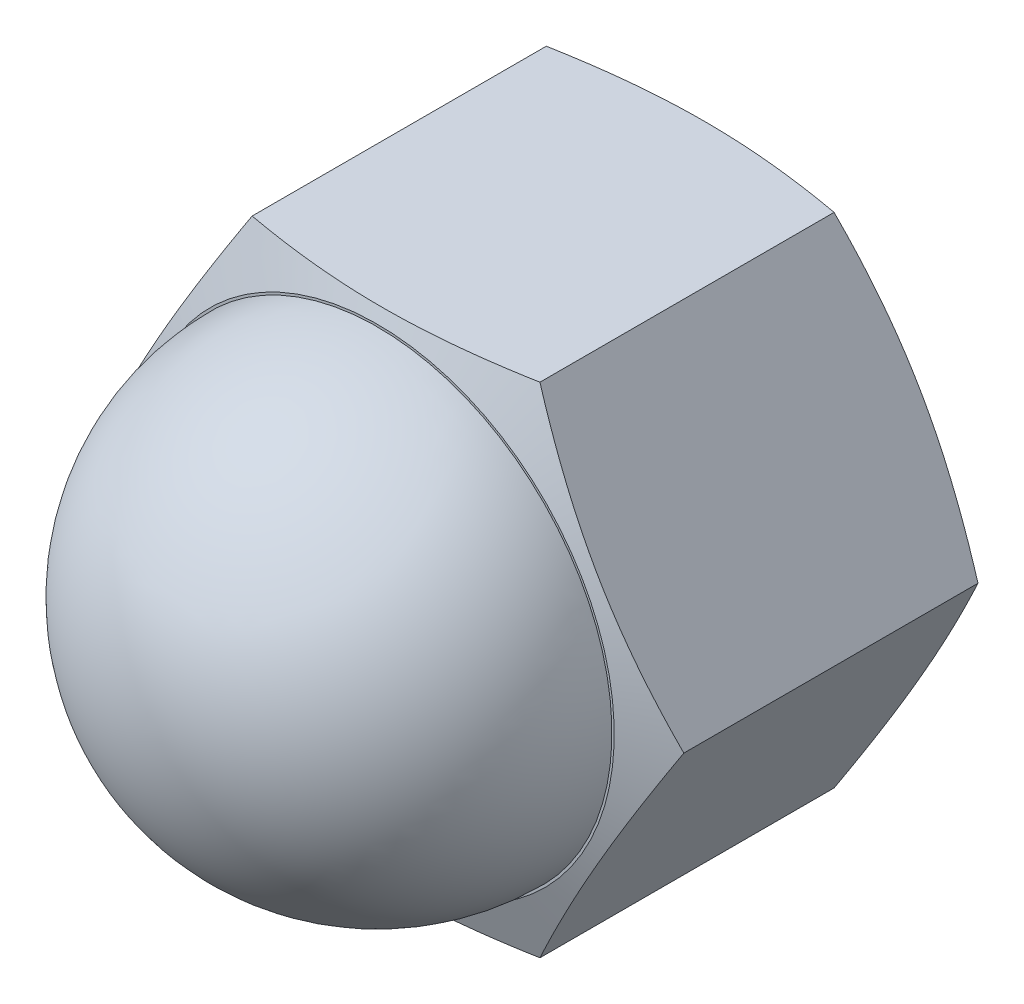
from build123d import *

# Parameters (mm, degrees)
SKETCH1_R        = 2.5
BASENUT_DEPTH    = 6.5
ENDCHAMFER_SIZE  = 0.65
ENDCHAMFER_SIZE2 = 0.375277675


with BuildPart() as part:
    # Sketch1 → BaseNut (new body)
    with BuildSketch(Plane.XY):
        Polygon((5.646485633, 0), (2.823242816, 4.89), (-2.823242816, 4.89), (-5.646485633, 0), (-2.823242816, -4.89), (2.823242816, -4.89), align=None)
        Circle(SKETCH1_R, mode=Mode.SUBTRACT)
    extrude(amount=-BASENUT_DEPTH)

    # Sketch2 → DoubleChamfer (revolve, cut)
    with BuildSketch(Plane(origin=(0, 0, 0), x_dir=(1, 0, 0), z_dir=(0, 1, 0))):
        Polygon((-4.6455, 6.5), (-5.646485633, 6.5), (-5.646485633, 6.135671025), align=None)
        Polygon((-5.646485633, 0.364328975), (-4.6455, 0), (-5.646485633, 0), align=None)
    revolve(axis=Axis((0, 0, -11.569441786), (0, 0, 1)), mode=Mode.SUBTRACT)

    # Sketch3 → Crown (revolve)
    with BuildSketch(Plane(origin=(-4.6, 0, -7.917622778), x_dir=(-1, 0, 0), z_dir=(0, 1, 0))):
        with BuildLine():
            Line((-4.6, 6.417622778), (-8.948562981, 6.417622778))
            ThreePointArc((-8.948562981, 6.417622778), (-8.34566416, 10.587828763), (-4.6, 12.517622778))
            Line((-4.6, 12.517622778), (-4.6, 6.417622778))
        make_face()
    revolve(axis=Axis((0, 0, -2.849184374), (0, 0, 1)))

    # EndChamfer
    endchamfer_edges = [part.edges().sort_by_distance(p)[0] for p in [
        (-2.5, 0, -6.5),
    ]]
    endchamfer_side = [part.faces().sort_by_distance(p)[0] for p in [
        (-2.5, 0, -4),
    ]]
    chamfer(endchamfer_edges, length=ENDCHAMFER_SIZE, length2=ENDCHAMFER_SIZE2, reference=endchamfer_side[0])


solid = part.part
